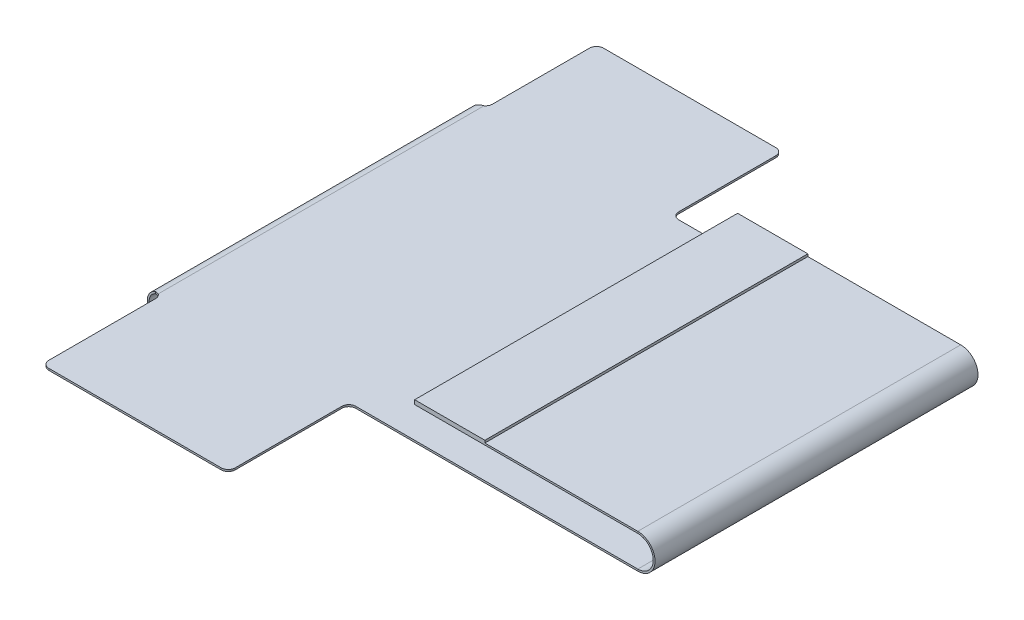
ISO-10303-21;
HEADER;
FILE_DESCRIPTION(('STEP AP214'),'2;1');
FILE_NAME('part.step','',(''),(''),'','','');
FILE_SCHEMA(('AUTOMOTIVE_DESIGN { 1 0 10303 214 1 1 1 1 }'));
ENDSEC;
DATA;
#1=APPLICATION_CONTEXT('core data for automotive mechanical design processes');
#2=APPLICATION_PROTOCOL_DEFINITION('international standard','automotive_design',2000,#1);
#3=PRODUCT_CONTEXT('',#1,'mechanical');
#4=PRODUCT('Part','Part','',(#3));
#5=PRODUCT_RELATED_PRODUCT_CATEGORY('part','',(#4));
#6=PRODUCT_DEFINITION_FORMATION('','',#4);
#7=PRODUCT_DEFINITION_CONTEXT('part definition',#1,'design');
#8=PRODUCT_DEFINITION('design','',#6,#7);
#9=PRODUCT_DEFINITION_SHAPE('','',#8);
#10=(LENGTH_UNIT() NAMED_UNIT(*) SI_UNIT(.MILLI.,.METRE.));
#11=(NAMED_UNIT(*) PLANE_ANGLE_UNIT() SI_UNIT($,.RADIAN.));
#12=(NAMED_UNIT(*) SI_UNIT($,.STERADIAN.) SOLID_ANGLE_UNIT());
#13=UNCERTAINTY_MEASURE_WITH_UNIT(LENGTH_MEASURE(1.E-05),#10,'distance_accuracy_value','');
#14=(GEOMETRIC_REPRESENTATION_CONTEXT(3) GLOBAL_UNCERTAINTY_ASSIGNED_CONTEXT((#13)) GLOBAL_UNIT_ASSIGNED_CONTEXT((#10,
#11,#12)) REPRESENTATION_CONTEXT('',''));
#15=CARTESIAN_POINT('',(0.,0.,0.));
#16=DIRECTION('',(0.,0.,1.));
#17=DIRECTION('',(1.,0.,0.));
#18=AXIS2_PLACEMENT_3D('',#15,#16,#17);
#19=CARTESIAN_POINT('',(74.6599554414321,2.33000000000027,12.));
#20=DIRECTION('',(0.,1.,0.));
#21=DIRECTION('',(0.,0.,-1.));
#22=AXIS2_PLACEMENT_3D('',#19,#20,#21);
#23=PLANE('',#22);
#24=DIRECTION('',(1.,0.,0.));
#25=VECTOR('',#24,1.);
#26=CARTESIAN_POINT('',(20.7599554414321,2.32999999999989,-11.5));
#27=LINE('',#26,#25);
#28=CARTESIAN_POINT('',(25.7599554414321,2.32999999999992,-11.5));
#29=VERTEX_POINT('',#28);
#30=CARTESIAN_POINT('',(36.65,2.33,-11.5));
#31=VERTEX_POINT('',#30);
#32=EDGE_CURVE('E426',#29,#31,#27,.T.);
#33=ORIENTED_EDGE('',*,*,#32,.F.);
#34=DIRECTION('',(0.,0.,-1.));
#35=VECTOR('',#34,1.);
#36=CARTESIAN_POINT('',(25.7599554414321,2.32999999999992,-11.5));
#37=LINE('',#36,#35);
#38=CARTESIAN_POINT('',(25.7599554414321,2.32999999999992,11.5));
#39=VERTEX_POINT('',#38);
#40=EDGE_CURVE('E406',#39,#29,#37,.T.);
#41=ORIENTED_EDGE('',*,*,#40,.F.);
#42=DIRECTION('',(-1.,0.,0.));
#43=VECTOR('',#42,1.);
#44=CARTESIAN_POINT('',(60.3899554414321,2.33000000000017,11.5));
#45=LINE('',#44,#43);
#46=CARTESIAN_POINT('',(36.65,2.33,11.5));
#47=VERTEX_POINT('',#46);
#48=EDGE_CURVE('E391',#47,#39,#45,.T.);
#49=ORIENTED_EDGE('',*,*,#48,.F.);
#50=DIRECTION('',(0.,0.,1.));
#51=VECTOR('',#50,1.);
#52=CARTESIAN_POINT('',(36.65,2.33,12.));
#53=LINE('',#52,#51);
#54=EDGE_CURVE('E415',#31,#47,#53,.T.);
#55=ORIENTED_EDGE('',*,*,#54,.F.);
#56=EDGE_LOOP('',(#33,#41,#49,#55));
#57=FACE_BOUND('',#56,.T.);
#58=ADVANCED_FACE('F180',(#57),#23,.T.);
#59=CARTESIAN_POINT('',(2.3,-0.13,12.));
#60=DIRECTION('',(0.,-1.,0.));
#61=DIRECTION('',(0.,0.,-1.));
#62=AXIS2_PLACEMENT_3D('',#59,#60,#61);
#63=PLANE('',#62);
#64=DIRECTION('',(-1.,0.,0.));
#65=VECTOR('',#64,1.);
#66=CARTESIAN_POINT('',(56.2,-0.13,-11.5));
#67=LINE('',#66,#65);
#68=CARTESIAN_POINT('',(36.65,-0.13,-11.5));
#69=VERTEX_POINT('',#68);
#70=CARTESIAN_POINT('',(16.57,-0.13,-11.5));
#71=VERTEX_POINT('',#70);
#72=EDGE_CURVE('E184',#69,#71,#67,.T.);
#73=ORIENTED_EDGE('',*,*,#72,.F.);
#74=DIRECTION('',(0.,0.,1.));
#75=VECTOR('',#74,1.);
#76=CARTESIAN_POINT('',(36.65,-0.13,12.));
#77=LINE('',#76,#75);
#78=CARTESIAN_POINT('',(36.65,-0.13,11.5));
#79=VERTEX_POINT('',#78);
#80=EDGE_CURVE('E741',#69,#79,#77,.T.);
#81=ORIENTED_EDGE('',*,*,#80,.T.);
#82=DIRECTION('',(1.,0.,0.));
#83=VECTOR('',#82,1.);
#84=CARTESIAN_POINT('',(16.57,-0.13,11.5));
#85=LINE('',#84,#83);
#86=CARTESIAN_POINT('',(16.57,-0.13,11.5));
#87=VERTEX_POINT('',#86);
#88=EDGE_CURVE('E754',#87,#79,#85,.T.);
#89=ORIENTED_EDGE('',*,*,#88,.F.);
#90=CARTESIAN_POINT('',(16.57,-0.13,12.));
#91=DIRECTION('',(0.,-1.,0.));
#92=DIRECTION('',(0.,0.,-1.));
#93=AXIS2_PLACEMENT_3D('',#90,#91,#92);
#94=CIRCLE('',#93,0.5);
#95=CARTESIAN_POINT('',(16.07,-0.13,12.));
#96=VERTEX_POINT('',#95);
#97=EDGE_CURVE('E824',#96,#87,#94,.T.);
#98=ORIENTED_EDGE('',*,*,#97,.F.);
#99=DIRECTION('',(0.,0.,-1.));
#100=VECTOR('',#99,1.);
#101=CARTESIAN_POINT('',(16.07,-0.13,19.59));
#102=LINE('',#101,#100);
#103=CARTESIAN_POINT('',(16.07,-0.13,19.59));
#104=VERTEX_POINT('',#103);
#105=EDGE_CURVE('E829',#104,#96,#102,.T.);
#106=ORIENTED_EDGE('',*,*,#105,.F.);
#107=CARTESIAN_POINT('',(15.57,-0.13,19.59));
#108=DIRECTION('',(0.,1.,0.));
#109=DIRECTION('',(0.,0.,1.));
#110=AXIS2_PLACEMENT_3D('',#107,#108,#109);
#111=CIRCLE('',#110,0.5);
#112=CARTESIAN_POINT('',(15.57,-0.13,20.09));
#113=VERTEX_POINT('',#112);
#114=EDGE_CURVE('E834',#113,#104,#111,.T.);
#115=ORIENTED_EDGE('',*,*,#114,.F.);
#116=DIRECTION('',(1.,0.,0.));
#117=VECTOR('',#116,1.);
#118=CARTESIAN_POINT('',(3.3,-0.13,20.09));
#119=LINE('',#118,#117);
#120=CARTESIAN_POINT('',(3.3,-0.13,20.09));
#121=VERTEX_POINT('',#120);
#122=EDGE_CURVE('E839',#121,#113,#119,.T.);
#123=ORIENTED_EDGE('',*,*,#122,.F.);
#124=CARTESIAN_POINT('',(3.3,-0.13,19.59));
#125=DIRECTION('',(0.,1.,0.));
#126=DIRECTION('',(0.,0.,1.));
#127=AXIS2_PLACEMENT_3D('',#124,#125,#126);
#128=CIRCLE('',#127,0.500000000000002);
#129=CARTESIAN_POINT('',(2.8,-0.13,19.59));
#130=VERTEX_POINT('',#129);
#131=EDGE_CURVE('E844',#130,#121,#128,.T.);
#132=ORIENTED_EDGE('',*,*,#131,.F.);
#133=DIRECTION('',(0.,0.,1.));
#134=VECTOR('',#133,1.);
#135=CARTESIAN_POINT('',(2.8,-0.13,12.));
#136=LINE('',#135,#134);
#137=CARTESIAN_POINT('',(2.8,-0.13,12.));
#138=VERTEX_POINT('',#137);
#139=EDGE_CURVE('E849',#138,#130,#136,.T.);
#140=ORIENTED_EDGE('',*,*,#139,.F.);
#141=CARTESIAN_POINT('',(2.3,-0.13,12.));
#142=DIRECTION('',(0.,-1.,0.));
#143=DIRECTION('',(0.,0.,-1.));
#144=AXIS2_PLACEMENT_3D('',#141,#142,#143);
#145=CIRCLE('',#144,0.5);
#146=CARTESIAN_POINT('',(2.6,-0.13,11.6));
#147=VERTEX_POINT('',#146);
#148=EDGE_CURVE('E705',#147,#138,#145,.T.);
#149=ORIENTED_EDGE('',*,*,#148,.F.);
#150=DIRECTION('',(0.,0.,1.));
#151=VECTOR('',#150,1.);
#152=CARTESIAN_POINT('',(2.6,-0.13,12.));
#153=LINE('',#152,#151);
#154=CARTESIAN_POINT('',(2.6,-0.13,-11.6));
#155=VERTEX_POINT('',#154);
#156=EDGE_CURVE('E856',#155,#147,#153,.T.);
#157=ORIENTED_EDGE('',*,*,#156,.F.);
#158=CARTESIAN_POINT('',(2.3,-0.13,-12.));
#159=DIRECTION('',(0.,-1.,0.));
#160=DIRECTION('',(0.,0.,-1.));
#161=AXIS2_PLACEMENT_3D('',#158,#159,#160);
#162=CIRCLE('',#161,0.5);
#163=CARTESIAN_POINT('',(2.8,-0.13,-12.));
#164=VERTEX_POINT('',#163);
#165=EDGE_CURVE('E690',#164,#155,#162,.T.);
#166=ORIENTED_EDGE('',*,*,#165,.F.);
#167=DIRECTION('',(0.,0.,1.));
#168=VECTOR('',#167,1.);
#169=CARTESIAN_POINT('',(2.8,-0.13,-18.91));
#170=LINE('',#169,#168);
#171=CARTESIAN_POINT('',(2.8,-0.13,-18.91));
#172=VERTEX_POINT('',#171);
#173=EDGE_CURVE('E793',#172,#164,#170,.T.);
#174=ORIENTED_EDGE('',*,*,#173,.F.);
#175=CARTESIAN_POINT('',(3.3,-0.13,-18.91));
#176=DIRECTION('',(0.,1.,0.));
#177=DIRECTION('',(0.,0.,1.));
#178=AXIS2_PLACEMENT_3D('',#175,#176,#177);
#179=CIRCLE('',#178,0.499999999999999);
#180=CARTESIAN_POINT('',(3.3,-0.13,-19.41));
#181=VERTEX_POINT('',#180);
#182=EDGE_CURVE('E798',#181,#172,#179,.T.);
#183=ORIENTED_EDGE('',*,*,#182,.F.);
#184=DIRECTION('',(-1.,0.,0.));
#185=VECTOR('',#184,1.);
#186=CARTESIAN_POINT('',(15.57,-0.13,-19.41));
#187=LINE('',#186,#185);
#188=CARTESIAN_POINT('',(15.57,-0.13,-19.41));
#189=VERTEX_POINT('',#188);
#190=EDGE_CURVE('E803',#189,#181,#187,.T.);
#191=ORIENTED_EDGE('',*,*,#190,.F.);
#192=CARTESIAN_POINT('',(15.57,-0.13,-18.91));
#193=DIRECTION('',(0.,1.,0.));
#194=DIRECTION('',(0.,0.,1.));
#195=AXIS2_PLACEMENT_3D('',#192,#193,#194);
#196=CIRCLE('',#195,0.500000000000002);
#197=CARTESIAN_POINT('',(16.07,-0.13,-18.91));
#198=VERTEX_POINT('',#197);
#199=EDGE_CURVE('E808',#198,#189,#196,.T.);
#200=ORIENTED_EDGE('',*,*,#199,.F.);
#201=DIRECTION('',(0.,0.,-1.));
#202=VECTOR('',#201,1.);
#203=CARTESIAN_POINT('',(16.07,-0.13,-12.));
#204=LINE('',#203,#202);
#205=CARTESIAN_POINT('',(16.07,-0.13,-12.));
#206=VERTEX_POINT('',#205);
#207=EDGE_CURVE('E813',#206,#198,#204,.T.);
#208=ORIENTED_EDGE('',*,*,#207,.F.);
#209=CARTESIAN_POINT('',(16.57,-0.13,-12.));
#210=DIRECTION('',(0.,-1.,0.));
#211=DIRECTION('',(0.,0.,-1.));
#212=AXIS2_PLACEMENT_3D('',#209,#210,#211);
#213=CIRCLE('',#212,0.5);
#214=EDGE_CURVE('E818',#71,#206,#213,.T.);
#215=ORIENTED_EDGE('',*,*,#214,.F.);
#216=EDGE_LOOP('',(#73,#81,#89,#98,#106,#115,#123,#132,#140,#149,#157,#166,#174,#183,#191,#200,
#208,#215));
#217=FACE_BOUND('',#216,.T.);
#218=ADVANCED_FACE('F909',(#217),#63,.T.);
#219=CARTESIAN_POINT('',(56.2,-0.13,-11.5));
#220=DIRECTION('',(0.,0.,-1.));
#221=DIRECTION('',(-1.,0.,0.));
#222=AXIS2_PLACEMENT_3D('',#219,#220,#221);
#223=PLANE('',#222);
#224=DIRECTION('',(-1.,0.,0.));
#225=VECTOR('',#224,1.);
#226=CARTESIAN_POINT('',(56.2,0.,-11.5));
#227=LINE('',#226,#225);
#228=CARTESIAN_POINT('',(36.65,0.,-11.5));
#229=VERTEX_POINT('',#228);
#230=CARTESIAN_POINT('',(16.57,0.,-11.5));
#231=VERTEX_POINT('',#230);
#232=EDGE_CURVE('E760',#229,#231,#227,.T.);
#233=ORIENTED_EDGE('',*,*,#232,.F.);
#234=DIRECTION('',(0.,-1.,0.));
#235=VECTOR('',#234,1.);
#236=CARTESIAN_POINT('',(36.65,-0.13,-11.5));
#237=LINE('',#236,#235);
#238=EDGE_CURVE('E750',#229,#69,#237,.T.);
#239=ORIENTED_EDGE('',*,*,#238,.T.);
#240=ORIENTED_EDGE('',*,*,#72,.T.);
#241=DIRECTION('',(0.,1.,0.));
#242=VECTOR('',#241,1.);
#243=CARTESIAN_POINT('',(16.57,-0.13,-11.5));
#244=LINE('',#243,#242);
#245=EDGE_CURVE('E821',#71,#231,#244,.T.);
#246=ORIENTED_EDGE('',*,*,#245,.T.);
#247=EDGE_LOOP('',(#233,#239,#240,#246));
#248=FACE_BOUND('',#247,.T.);
#249=ADVANCED_FACE('F915',(#248),#223,.T.);
#250=CARTESIAN_POINT('',(16.57,-0.13,11.5));
#251=DIRECTION('',(0.,0.,1.));
#252=DIRECTION('',(1.,0.,0.));
#253=AXIS2_PLACEMENT_3D('',#250,#251,#252);
#254=PLANE('',#253);
#255=ORIENTED_EDGE('',*,*,#88,.T.);
#256=DIRECTION('',(0.,1.,0.));
#257=VECTOR('',#256,1.);
#258=CARTESIAN_POINT('',(36.65,-0.13,11.5));
#259=LINE('',#258,#257);
#260=CARTESIAN_POINT('',(36.65,0.,11.5));
#261=VERTEX_POINT('',#260);
#262=EDGE_CURVE('E12',#79,#261,#259,.T.);
#263=ORIENTED_EDGE('',*,*,#262,.T.);
#264=DIRECTION('',(1.,0.,0.));
#265=VECTOR('',#264,1.);
#266=CARTESIAN_POINT('',(16.57,0.,11.5));
#267=LINE('',#266,#265);
#268=CARTESIAN_POINT('',(16.57,0.,11.5));
#269=VERTEX_POINT('',#268);
#270=EDGE_CURVE('E758',#269,#261,#267,.T.);
#271=ORIENTED_EDGE('',*,*,#270,.F.);
#272=DIRECTION('',(0.,1.,0.));
#273=VECTOR('',#272,1.);
#274=CARTESIAN_POINT('',(16.57,-0.13,11.5));
#275=LINE('',#274,#273);
#276=EDGE_CURVE('E757',#87,#269,#275,.T.);
#277=ORIENTED_EDGE('',*,*,#276,.F.);
#278=EDGE_LOOP('',(#255,#263,#271,#277));
#279=FACE_BOUND('',#278,.T.);
#280=ADVANCED_FACE('F182',(#279),#254,.T.);
#281=CARTESIAN_POINT('',(2.63960198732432,-1.63,11.5));
#282=DIRECTION('',(0.,0.,1.));
#283=DIRECTION('',(-1.,0.,0.));
#284=AXIS2_PLACEMENT_3D('',#281,#282,#283);
#285=PLANE('',#284);
#286=DIRECTION('',(-1.,0.,0.));
#287=VECTOR('',#286,1.);
#288=CARTESIAN_POINT('',(2.63960198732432,-1.63,11.5));
#289=LINE('',#288,#287);
#290=CARTESIAN_POINT('',(2.63960198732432,-1.63,11.5));
#291=VERTEX_POINT('',#290);
#292=CARTESIAN_POINT('',(2.60000000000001,-1.63,11.5));
#293=VERTEX_POINT('',#292);
#294=EDGE_CURVE('E718',#291,#293,#289,.T.);
#295=ORIENTED_EDGE('',*,*,#294,.T.);
#296=DIRECTION('',(0.,-1.,0.));
#297=VECTOR('',#296,1.);
#298=CARTESIAN_POINT('',(2.60000000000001,-1.63,11.5));
#299=LINE('',#298,#297);
#300=CARTESIAN_POINT('',(2.60000000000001,-1.76,11.5));
#301=VERTEX_POINT('',#300);
#302=EDGE_CURVE('E738',#293,#301,#299,.T.);
#303=ORIENTED_EDGE('',*,*,#302,.T.);
#304=DIRECTION('',(-1.,0.,0.));
#305=VECTOR('',#304,1.);
#306=CARTESIAN_POINT('',(2.63960198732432,-1.76,11.5));
#307=LINE('',#306,#305);
#308=CARTESIAN_POINT('',(2.63960198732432,-1.76,11.5));
#309=VERTEX_POINT('',#308);
#310=EDGE_CURVE('E723',#309,#301,#307,.T.);
#311=ORIENTED_EDGE('',*,*,#310,.F.);
#312=DIRECTION('',(0.,-1.,0.));
#313=VECTOR('',#312,1.);
#314=CARTESIAN_POINT('',(2.63960198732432,-1.63,11.5));
#315=LINE('',#314,#313);
#316=EDGE_CURVE('E725',#291,#309,#315,.T.);
#317=ORIENTED_EDGE('',*,*,#316,.F.);
#318=EDGE_LOOP('',(#295,#303,#311,#317));
#319=FACE_BOUND('',#318,.T.);
#320=ADVANCED_FACE('F892',(#319),#285,.T.);
#321=CARTESIAN_POINT('',(0.339601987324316,-1.63000000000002,-11.5));
#322=DIRECTION('',(0.,0.,-1.));
#323=DIRECTION('',(1.,0.,0.));
#324=AXIS2_PLACEMENT_3D('',#321,#322,#323);
#325=PLANE('',#324);
#326=DIRECTION('',(1.,0.,0.));
#327=VECTOR('',#326,1.);
#328=CARTESIAN_POINT('',(0.339601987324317,-1.76000000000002,-11.5));
#329=LINE('',#328,#327);
#330=CARTESIAN_POINT('',(2.60000000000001,-1.76,-11.5));
#331=VERTEX_POINT('',#330);
#332=CARTESIAN_POINT('',(2.63960198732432,-1.76,-11.5));
#333=VERTEX_POINT('',#332);
#334=EDGE_CURVE('E724',#331,#333,#329,.T.);
#335=ORIENTED_EDGE('',*,*,#334,.F.);
#336=DIRECTION('',(0.,1.,0.));
#337=VECTOR('',#336,1.);
#338=CARTESIAN_POINT('',(2.6,-1.63,-11.5));
#339=LINE('',#338,#337);
#340=CARTESIAN_POINT('',(2.60000000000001,-1.63,-11.5));
#341=VERTEX_POINT('',#340);
#342=EDGE_CURVE('E733',#331,#341,#339,.T.);
#343=ORIENTED_EDGE('',*,*,#342,.T.);
#344=DIRECTION('',(1.,0.,0.));
#345=VECTOR('',#344,1.);
#346=CARTESIAN_POINT('',(0.339601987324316,-1.63000000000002,-11.5));
#347=LINE('',#346,#345);
#348=CARTESIAN_POINT('',(2.63960198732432,-1.63,-11.5));
#349=VERTEX_POINT('',#348);
#350=EDGE_CURVE('E719',#341,#349,#347,.T.);
#351=ORIENTED_EDGE('',*,*,#350,.T.);
#352=DIRECTION('',(0.,-1.,0.));
#353=VECTOR('',#352,1.);
#354=CARTESIAN_POINT('',(2.63960198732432,-1.63,-11.5));
#355=LINE('',#354,#353);
#356=EDGE_CURVE('E728',#349,#333,#355,.T.);
#357=ORIENTED_EDGE('',*,*,#356,.T.);
#358=EDGE_LOOP('',(#335,#343,#351,#357));
#359=FACE_BOUND('',#358,.T.);
#360=ADVANCED_FACE('F903',(#359),#325,.T.);
#361=CARTESIAN_POINT('',(0.339601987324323,-1.63000000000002,12.));
#362=DIRECTION('',(0.,1.,0.));
#363=DIRECTION('',(0.,0.,-1.));
#364=AXIS2_PLACEMENT_3D('',#361,#362,#363);
#365=PLANE('',#364);
#366=ORIENTED_EDGE('',*,*,#350,.F.);
#367=DIRECTION('',(0.,0.,1.));
#368=VECTOR('',#367,1.);
#369=CARTESIAN_POINT('',(2.60000000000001,-1.63,12.));
#370=LINE('',#369,#368);
#371=EDGE_CURVE('E727',#341,#293,#370,.T.);
#372=ORIENTED_EDGE('',*,*,#371,.T.);
#373=ORIENTED_EDGE('',*,*,#294,.F.);
#374=DIRECTION('',(0.,0.,1.));
#375=VECTOR('',#374,1.);
#376=CARTESIAN_POINT('',(2.63960198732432,-1.63,-11.5));
#377=LINE('',#376,#375);
#378=EDGE_CURVE('E715',#349,#291,#377,.T.);
#379=ORIENTED_EDGE('',*,*,#378,.F.);
#380=EDGE_LOOP('',(#366,#372,#373,#379));
#381=FACE_BOUND('',#380,.T.);
#382=ADVANCED_FACE('F897',(#381),#365,.T.);
#383=CARTESIAN_POINT('',(2.63960198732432,-1.63,-11.5));
#384=DIRECTION('',(1.,0.,0.));
#385=DIRECTION('',(0.,0.,1.));
#386=AXIS2_PLACEMENT_3D('',#383,#384,#385);
#387=PLANE('',#386);
#388=DIRECTION('',(0.,0.,1.));
#389=VECTOR('',#388,1.);
#390=CARTESIAN_POINT('',(2.63960198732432,-1.76,-11.5));
#391=LINE('',#390,#389);
#392=EDGE_CURVE('E720',#333,#309,#391,.T.);
#393=ORIENTED_EDGE('',*,*,#392,.F.);
#394=ORIENTED_EDGE('',*,*,#356,.F.);
#395=ORIENTED_EDGE('',*,*,#378,.T.);
#396=ORIENTED_EDGE('',*,*,#316,.T.);
#397=EDGE_LOOP('',(#393,#394,#395,#396));
#398=FACE_BOUND('',#397,.T.);
#399=ADVANCED_FACE('F900',(#398),#387,.T.);
#400=CARTESIAN_POINT('',(0.339601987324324,-1.76000000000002,12.));
#401=DIRECTION('',(0.,1.,0.));
#402=DIRECTION('',(0.,0.,-1.));
#403=AXIS2_PLACEMENT_3D('',#400,#401,#402);
#404=PLANE('',#403);
#405=DIRECTION('',(0.,0.,1.));
#406=VECTOR('',#405,1.);
#407=CARTESIAN_POINT('',(2.60000000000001,-1.76,12.));
#408=LINE('',#407,#406);
#409=EDGE_CURVE('E736',#331,#301,#408,.T.);
#410=ORIENTED_EDGE('',*,*,#409,.F.);
#411=ORIENTED_EDGE('',*,*,#334,.T.);
#412=ORIENTED_EDGE('',*,*,#392,.T.);
#413=ORIENTED_EDGE('',*,*,#310,.T.);
#414=EDGE_LOOP('',(#410,#411,#412,#413));
#415=FACE_BOUND('',#414,.T.);
#416=ADVANCED_FACE('F616',(#415),#404,.F.);
#417=CARTESIAN_POINT('',(2.8,-0.13,12.));
#418=DIRECTION('',(-1.,0.,0.));
#419=DIRECTION('',(0.,0.,1.));
#420=AXIS2_PLACEMENT_3D('',#417,#418,#419);
#421=PLANE('',#420);
#422=DIRECTION('',(0.,0.,1.));
#423=VECTOR('',#422,1.);
#424=CARTESIAN_POINT('',(2.8,0.,12.));
#425=LINE('',#424,#423);
#426=CARTESIAN_POINT('',(2.8,0.,12.));
#427=VERTEX_POINT('',#426);
#428=CARTESIAN_POINT('',(2.8,0.,19.59));
#429=VERTEX_POINT('',#428);
#430=EDGE_CURVE('E694',#427,#429,#425,.T.);
#431=ORIENTED_EDGE('',*,*,#430,.F.);
#432=DIRECTION('',(0.,1.,0.));
#433=VECTOR('',#432,1.);
#434=CARTESIAN_POINT('',(2.8,-0.13,12.));
#435=LINE('',#434,#433);
#436=EDGE_CURVE('E602',#138,#427,#435,.T.);
#437=ORIENTED_EDGE('',*,*,#436,.F.);
#438=ORIENTED_EDGE('',*,*,#139,.T.);
#439=DIRECTION('',(0.,1.,0.));
#440=VECTOR('',#439,1.);
#441=CARTESIAN_POINT('',(2.8,-0.13,19.59));
#442=LINE('',#441,#440);
#443=EDGE_CURVE('E847',#130,#429,#442,.T.);
#444=ORIENTED_EDGE('',*,*,#443,.T.);
#445=EDGE_LOOP('',(#431,#437,#438,#444));
#446=FACE_BOUND('',#445,.T.);
#447=ADVANCED_FACE('F612',(#446),#421,.T.);
#448=CARTESIAN_POINT('',(3.3,-0.13,19.59));
#449=DIRECTION('',(0.,1.,0.));
#450=DIRECTION('',(0.,0.,1.));
#451=AXIS2_PLACEMENT_3D('',#448,#449,#450);
#452=CYLINDRICAL_SURFACE('',#451,0.500000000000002);
#453=CARTESIAN_POINT('',(3.3,0.,19.59));
#454=DIRECTION('',(0.,1.,0.));
#455=DIRECTION('',(0.,0.,1.));
#456=AXIS2_PLACEMENT_3D('',#453,#454,#455);
#457=CIRCLE('',#456,0.500000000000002);
#458=CARTESIAN_POINT('',(3.3,0.,20.09));
#459=VERTEX_POINT('',#458);
#460=EDGE_CURVE('E786',#429,#459,#457,.T.);
#461=ORIENTED_EDGE('',*,*,#460,.F.);
#462=ORIENTED_EDGE('',*,*,#443,.F.);
#463=ORIENTED_EDGE('',*,*,#131,.T.);
#464=DIRECTION('',(0.,1.,0.));
#465=VECTOR('',#464,1.);
#466=CARTESIAN_POINT('',(3.3,-0.13,20.09));
#467=LINE('',#466,#465);
#468=EDGE_CURVE('E842',#121,#459,#467,.T.);
#469=ORIENTED_EDGE('',*,*,#468,.T.);
#470=EDGE_LOOP('',(#461,#462,#463,#469));
#471=FACE_BOUND('',#470,.T.);
#472=ADVANCED_FACE('F615',(#471),#452,.T.);
#473=CARTESIAN_POINT('',(3.3,-0.13,20.09));
#474=DIRECTION('',(0.,0.,1.));
#475=DIRECTION('',(1.,0.,0.));
#476=AXIS2_PLACEMENT_3D('',#473,#474,#475);
#477=PLANE('',#476);
#478=DIRECTION('',(1.,0.,0.));
#479=VECTOR('',#478,1.);
#480=CARTESIAN_POINT('',(3.3,0.,20.09));
#481=LINE('',#480,#479);
#482=CARTESIAN_POINT('',(15.57,0.,20.09));
#483=VERTEX_POINT('',#482);
#484=EDGE_CURVE('E783',#459,#483,#481,.T.);
#485=ORIENTED_EDGE('',*,*,#484,.F.);
#486=ORIENTED_EDGE('',*,*,#468,.F.);
#487=ORIENTED_EDGE('',*,*,#122,.T.);
#488=DIRECTION('',(0.,1.,0.));
#489=VECTOR('',#488,1.);
#490=CARTESIAN_POINT('',(15.57,-0.13,20.09));
#491=LINE('',#490,#489);
#492=EDGE_CURVE('E837',#113,#483,#491,.T.);
#493=ORIENTED_EDGE('',*,*,#492,.T.);
#494=EDGE_LOOP('',(#485,#486,#487,#493));
#495=FACE_BOUND('',#494,.T.);
#496=ADVANCED_FACE('F620',(#495),#477,.T.);
#497=CARTESIAN_POINT('',(15.57,-0.13,19.59));
#498=DIRECTION('',(0.,1.,0.));
#499=DIRECTION('',(0.,0.,1.));
#500=AXIS2_PLACEMENT_3D('',#497,#498,#499);
#501=CYLINDRICAL_SURFACE('',#500,0.5);
#502=CARTESIAN_POINT('',(15.57,0.,19.59));
#503=DIRECTION('',(0.,1.,0.));
#504=DIRECTION('',(0.,0.,1.));
#505=AXIS2_PLACEMENT_3D('',#502,#503,#504);
#506=CIRCLE('',#505,0.5);
#507=CARTESIAN_POINT('',(16.07,0.,19.59));
#508=VERTEX_POINT('',#507);
#509=EDGE_CURVE('E780',#483,#508,#506,.T.);
#510=ORIENTED_EDGE('',*,*,#509,.F.);
#511=ORIENTED_EDGE('',*,*,#492,.F.);
#512=ORIENTED_EDGE('',*,*,#114,.T.);
#513=DIRECTION('',(0.,1.,0.));
#514=VECTOR('',#513,1.);
#515=CARTESIAN_POINT('',(16.07,-0.13,19.59));
#516=LINE('',#515,#514);
#517=EDGE_CURVE('E832',#104,#508,#516,.T.);
#518=ORIENTED_EDGE('',*,*,#517,.T.);
#519=EDGE_LOOP('',(#510,#511,#512,#518));
#520=FACE_BOUND('',#519,.T.);
#521=ADVANCED_FACE('F624',(#520),#501,.T.);
#522=CARTESIAN_POINT('',(16.07,-0.13,19.59));
#523=DIRECTION('',(1.,0.,0.));
#524=DIRECTION('',(0.,0.,-1.));
#525=AXIS2_PLACEMENT_3D('',#522,#523,#524);
#526=PLANE('',#525);
#527=DIRECTION('',(0.,0.,-1.));
#528=VECTOR('',#527,1.);
#529=CARTESIAN_POINT('',(16.07,0.,19.59));
#530=LINE('',#529,#528);
#531=CARTESIAN_POINT('',(16.07,0.,12.));
#532=VERTEX_POINT('',#531);
#533=EDGE_CURVE('E777',#508,#532,#530,.T.);
#534=ORIENTED_EDGE('',*,*,#533,.F.);
#535=ORIENTED_EDGE('',*,*,#517,.F.);
#536=ORIENTED_EDGE('',*,*,#105,.T.);
#537=DIRECTION('',(0.,1.,0.));
#538=VECTOR('',#537,1.);
#539=CARTESIAN_POINT('',(16.07,-0.13,12.));
#540=LINE('',#539,#538);
#541=EDGE_CURVE('E827',#96,#532,#540,.T.);
#542=ORIENTED_EDGE('',*,*,#541,.T.);
#543=EDGE_LOOP('',(#534,#535,#536,#542));
#544=FACE_BOUND('',#543,.T.);
#545=ADVANCED_FACE('F628',(#544),#526,.T.);
#546=CARTESIAN_POINT('',(16.57,-0.13,12.));
#547=DIRECTION('',(0.,1.,0.));
#548=DIRECTION('',(0.,0.,1.));
#549=AXIS2_PLACEMENT_3D('',#546,#547,#548);
#550=CYLINDRICAL_SURFACE('',#549,0.5);
#551=CARTESIAN_POINT('',(16.57,0.,12.));
#552=DIRECTION('',(0.,-1.,0.));
#553=DIRECTION('',(0.,0.,-1.));
#554=AXIS2_PLACEMENT_3D('',#551,#552,#553);
#555=CIRCLE('',#554,0.5);
#556=EDGE_CURVE('E761',#532,#269,#555,.T.);
#557=ORIENTED_EDGE('',*,*,#556,.F.);
#558=ORIENTED_EDGE('',*,*,#541,.F.);
#559=ORIENTED_EDGE('',*,*,#97,.T.);
#560=ORIENTED_EDGE('',*,*,#276,.T.);
#561=EDGE_LOOP('',(#557,#558,#559,#560));
#562=FACE_BOUND('',#561,.T.);
#563=ADVANCED_FACE('F632',(#562),#550,.F.);
#564=CARTESIAN_POINT('',(16.57,-0.13,-12.));
#565=DIRECTION('',(0.,1.,0.));
#566=DIRECTION('',(0.,0.,1.));
#567=AXIS2_PLACEMENT_3D('',#564,#565,#566);
#568=CYLINDRICAL_SURFACE('',#567,0.5);
#569=CARTESIAN_POINT('',(16.57,0.,-12.));
#570=DIRECTION('',(0.,-1.,0.));
#571=DIRECTION('',(0.,0.,-1.));
#572=AXIS2_PLACEMENT_3D('',#569,#570,#571);
#573=CIRCLE('',#572,0.5);
#574=CARTESIAN_POINT('',(16.07,0.,-12.));
#575=VERTEX_POINT('',#574);
#576=EDGE_CURVE('E762',#231,#575,#573,.T.);
#577=ORIENTED_EDGE('',*,*,#576,.F.);
#578=ORIENTED_EDGE('',*,*,#245,.F.);
#579=ORIENTED_EDGE('',*,*,#214,.T.);
#580=DIRECTION('',(0.,1.,0.));
#581=VECTOR('',#580,1.);
#582=CARTESIAN_POINT('',(16.07,-0.13,-12.));
#583=LINE('',#582,#581);
#584=EDGE_CURVE('E816',#206,#575,#583,.T.);
#585=ORIENTED_EDGE('',*,*,#584,.T.);
#586=EDGE_LOOP('',(#577,#578,#579,#585));
#587=FACE_BOUND('',#586,.T.);
#588=ADVANCED_FACE('F636',(#587),#568,.F.);
#589=CARTESIAN_POINT('',(16.07,-0.13,-12.));
#590=DIRECTION('',(1.,0.,0.));
#591=DIRECTION('',(0.,0.,-1.));
#592=AXIS2_PLACEMENT_3D('',#589,#590,#591);
#593=PLANE('',#592);
#594=DIRECTION('',(0.,0.,-1.));
#595=VECTOR('',#594,1.);
#596=CARTESIAN_POINT('',(16.07,0.,-12.));
#597=LINE('',#596,#595);
#598=CARTESIAN_POINT('',(16.07,0.,-18.91));
#599=VERTEX_POINT('',#598);
#600=EDGE_CURVE('E767',#575,#599,#597,.T.);
#601=ORIENTED_EDGE('',*,*,#600,.F.);
#602=ORIENTED_EDGE('',*,*,#584,.F.);
#603=ORIENTED_EDGE('',*,*,#207,.T.);
#604=DIRECTION('',(0.,1.,0.));
#605=VECTOR('',#604,1.);
#606=CARTESIAN_POINT('',(16.07,-0.13,-18.91));
#607=LINE('',#606,#605);
#608=EDGE_CURVE('E811',#198,#599,#607,.T.);
#609=ORIENTED_EDGE('',*,*,#608,.T.);
#610=EDGE_LOOP('',(#601,#602,#603,#609));
#611=FACE_BOUND('',#610,.T.);
#612=ADVANCED_FACE('F640',(#611),#593,.T.);
#613=CARTESIAN_POINT('',(15.57,-0.13,-18.91));
#614=DIRECTION('',(0.,1.,0.));
#615=DIRECTION('',(0.,0.,1.));
#616=AXIS2_PLACEMENT_3D('',#613,#614,#615);
#617=CYLINDRICAL_SURFACE('',#616,0.500000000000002);
#618=CARTESIAN_POINT('',(15.57,0.,-18.91));
#619=DIRECTION('',(0.,1.,0.));
#620=DIRECTION('',(0.,0.,1.));
#621=AXIS2_PLACEMENT_3D('',#618,#619,#620);
#622=CIRCLE('',#621,0.500000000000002);
#623=CARTESIAN_POINT('',(15.57,0.,-19.41));
#624=VERTEX_POINT('',#623);
#625=EDGE_CURVE('E771',#599,#624,#622,.T.);
#626=ORIENTED_EDGE('',*,*,#625,.F.);
#627=ORIENTED_EDGE('',*,*,#608,.F.);
#628=ORIENTED_EDGE('',*,*,#199,.T.);
#629=DIRECTION('',(0.,1.,0.));
#630=VECTOR('',#629,1.);
#631=CARTESIAN_POINT('',(15.57,-0.13,-19.41));
#632=LINE('',#631,#630);
#633=EDGE_CURVE('E806',#189,#624,#632,.T.);
#634=ORIENTED_EDGE('',*,*,#633,.T.);
#635=EDGE_LOOP('',(#626,#627,#628,#634));
#636=FACE_BOUND('',#635,.T.);
#637=ADVANCED_FACE('F644',(#636),#617,.T.);
#638=CARTESIAN_POINT('',(15.57,-0.13,-19.41));
#639=DIRECTION('',(0.,0.,-1.));
#640=DIRECTION('',(-1.,0.,0.));
#641=AXIS2_PLACEMENT_3D('',#638,#639,#640);
#642=PLANE('',#641);
#643=DIRECTION('',(-1.,0.,0.));
#644=VECTOR('',#643,1.);
#645=CARTESIAN_POINT('',(15.57,0.,-19.41));
#646=LINE('',#645,#644);
#647=CARTESIAN_POINT('',(3.3,0.,-19.41));
#648=VERTEX_POINT('',#647);
#649=EDGE_CURVE('E969',#624,#648,#646,.T.);
#650=ORIENTED_EDGE('',*,*,#649,.F.);
#651=ORIENTED_EDGE('',*,*,#633,.F.);
#652=ORIENTED_EDGE('',*,*,#190,.T.);
#653=DIRECTION('',(0.,1.,0.));
#654=VECTOR('',#653,1.);
#655=CARTESIAN_POINT('',(3.3,-0.13,-19.41));
#656=LINE('',#655,#654);
#657=EDGE_CURVE('E801',#181,#648,#656,.T.);
#658=ORIENTED_EDGE('',*,*,#657,.T.);
#659=EDGE_LOOP('',(#650,#651,#652,#658));
#660=FACE_BOUND('',#659,.T.);
#661=ADVANCED_FACE('F648',(#660),#642,.T.);
#662=CARTESIAN_POINT('',(3.3,-0.13,-18.91));
#663=DIRECTION('',(0.,1.,0.));
#664=DIRECTION('',(0.,0.,1.));
#665=AXIS2_PLACEMENT_3D('',#662,#663,#664);
#666=CYLINDRICAL_SURFACE('',#665,0.499999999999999);
#667=CARTESIAN_POINT('',(3.3,0.,-18.91));
#668=DIRECTION('',(0.,1.,0.));
#669=DIRECTION('',(0.,0.,1.));
#670=AXIS2_PLACEMENT_3D('',#667,#668,#669);
#671=CIRCLE('',#670,0.499999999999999);
#672=CARTESIAN_POINT('',(2.8,0.,-18.91));
#673=VERTEX_POINT('',#672);
#674=EDGE_CURVE('E970',#648,#673,#671,.T.);
#675=ORIENTED_EDGE('',*,*,#674,.F.);
#676=ORIENTED_EDGE('',*,*,#657,.F.);
#677=ORIENTED_EDGE('',*,*,#182,.T.);
#678=DIRECTION('',(0.,1.,0.));
#679=VECTOR('',#678,1.);
#680=CARTESIAN_POINT('',(2.8,-0.13,-18.91));
#681=LINE('',#680,#679);
#682=EDGE_CURVE('E796',#172,#673,#681,.T.);
#683=ORIENTED_EDGE('',*,*,#682,.T.);
#684=EDGE_LOOP('',(#675,#676,#677,#683));
#685=FACE_BOUND('',#684,.T.);
#686=ADVANCED_FACE('F652',(#685),#666,.T.);
#687=CARTESIAN_POINT('',(2.8,-0.13,-18.91));
#688=DIRECTION('',(-1.,0.,0.));
#689=DIRECTION('',(0.,0.,1.));
#690=AXIS2_PLACEMENT_3D('',#687,#688,#689);
#691=PLANE('',#690);
#692=DIRECTION('',(0.,0.,1.));
#693=VECTOR('',#692,1.);
#694=CARTESIAN_POINT('',(2.8,0.,-18.91));
#695=LINE('',#694,#693);
#696=CARTESIAN_POINT('',(2.8,0.,-12.));
#697=VERTEX_POINT('',#696);
#698=EDGE_CURVE('E712',#673,#697,#695,.T.);
#699=ORIENTED_EDGE('',*,*,#698,.F.);
#700=ORIENTED_EDGE('',*,*,#682,.F.);
#701=ORIENTED_EDGE('',*,*,#173,.T.);
#702=DIRECTION('',(0.,1.,0.));
#703=VECTOR('',#702,1.);
#704=CARTESIAN_POINT('',(2.8,-0.13,-12.));
#705=LINE('',#704,#703);
#706=EDGE_CURVE('E791',#164,#697,#705,.T.);
#707=ORIENTED_EDGE('',*,*,#706,.T.);
#708=EDGE_LOOP('',(#699,#700,#701,#707));
#709=FACE_BOUND('',#708,.T.);
#710=ADVANCED_FACE('F656',(#709),#691,.T.);
#711=CARTESIAN_POINT('',(2.3,-0.13,-12.));
#712=DIRECTION('',(0.,1.,0.));
#713=DIRECTION('',(0.,0.,1.));
#714=AXIS2_PLACEMENT_3D('',#711,#712,#713);
#715=CYLINDRICAL_SURFACE('',#714,0.5);
#716=CARTESIAN_POINT('',(2.6,0.,-11.6));
#717=CARTESIAN_POINT('',(2.6,-0.13,-11.6));
#718=B_SPLINE_CURVE_WITH_KNOTS('',1,(#716,#717),.UNSPECIFIED.,.F.,.F.,(2,2),(0.,1.),.UNSPECIFIED.);
#719=CARTESIAN_POINT('',(2.6,0.,-11.6));
#720=VERTEX_POINT('',#719);
#721=EDGE_CURVE('E852',#720,#155,#718,.T.);
#722=ORIENTED_EDGE('',*,*,#721,.F.);
#723=CARTESIAN_POINT('',(2.3,0.,-12.));
#724=DIRECTION('',(0.,-1.,0.));
#725=DIRECTION('',(0.,0.,-1.));
#726=AXIS2_PLACEMENT_3D('',#723,#724,#725);
#727=CIRCLE('',#726,0.5);
#728=EDGE_CURVE('E686',#697,#720,#727,.T.);
#729=ORIENTED_EDGE('',*,*,#728,.F.);
#730=ORIENTED_EDGE('',*,*,#706,.F.);
#731=ORIENTED_EDGE('',*,*,#165,.T.);
#732=EDGE_LOOP('',(#722,#729,#730,#731));
#733=FACE_BOUND('',#732,.T.);
#734=ADVANCED_FACE('F660',(#733),#715,.F.);
#735=CARTESIAN_POINT('',(2.3,0.,12.));
#736=DIRECTION('',(0.,-1.,0.));
#737=DIRECTION('',(0.,0.,-1.));
#738=AXIS2_PLACEMENT_3D('',#735,#736,#737);
#739=PLANE('',#738);
#740=DIRECTION('',(0.,0.,1.));
#741=VECTOR('',#740,1.);
#742=CARTESIAN_POINT('',(36.65,0.,12.));
#743=LINE('',#742,#741);
#744=EDGE_CURVE('E189',#229,#261,#743,.T.);
#745=ORIENTED_EDGE('',*,*,#744,.F.);
#746=ORIENTED_EDGE('',*,*,#232,.T.);
#747=ORIENTED_EDGE('',*,*,#576,.T.);
#748=ORIENTED_EDGE('',*,*,#600,.T.);
#749=ORIENTED_EDGE('',*,*,#625,.T.);
#750=ORIENTED_EDGE('',*,*,#649,.T.);
#751=ORIENTED_EDGE('',*,*,#674,.T.);
#752=ORIENTED_EDGE('',*,*,#698,.T.);
#753=ORIENTED_EDGE('',*,*,#728,.T.);
#754=DIRECTION('',(0.,0.,1.));
#755=VECTOR('',#754,1.);
#756=CARTESIAN_POINT('',(2.6,0.,12.));
#757=LINE('',#756,#755);
#758=CARTESIAN_POINT('',(2.6,0.,11.6));
#759=VERTEX_POINT('',#758);
#760=EDGE_CURVE('E677',#720,#759,#757,.T.);
#761=ORIENTED_EDGE('',*,*,#760,.T.);
#762=CARTESIAN_POINT('',(2.3,0.,12.));
#763=DIRECTION('',(0.,-1.,0.));
#764=DIRECTION('',(0.,0.,-1.));
#765=AXIS2_PLACEMENT_3D('',#762,#763,#764);
#766=CIRCLE('',#765,0.5);
#767=EDGE_CURVE('E685',#759,#427,#766,.T.);
#768=ORIENTED_EDGE('',*,*,#767,.T.);
#769=ORIENTED_EDGE('',*,*,#430,.T.);
#770=ORIENTED_EDGE('',*,*,#460,.T.);
#771=ORIENTED_EDGE('',*,*,#484,.T.);
#772=ORIENTED_EDGE('',*,*,#509,.T.);
#773=ORIENTED_EDGE('',*,*,#533,.T.);
#774=ORIENTED_EDGE('',*,*,#556,.T.);
#775=ORIENTED_EDGE('',*,*,#270,.T.);
#776=EDGE_LOOP('',(#745,#746,#747,#748,#749,#750,#751,#752,#753,#761,#768,#769,#770,#771,#772,
#773,#774,#775));
#777=FACE_BOUND('',#776,.T.);
#778=ADVANCED_FACE('F665',(#777),#739,.F.);
#779=CARTESIAN_POINT('',(2.3,-0.13,12.));
#780=DIRECTION('',(0.,1.,0.));
#781=DIRECTION('',(0.,0.,1.));
#782=AXIS2_PLACEMENT_3D('',#779,#780,#781);
#783=CYLINDRICAL_SURFACE('',#782,0.5);
#784=CARTESIAN_POINT('',(2.6,-0.13,11.6));
#785=CARTESIAN_POINT('',(2.6,0.,11.6));
#786=B_SPLINE_CURVE_WITH_KNOTS('',1,(#784,#785),.UNSPECIFIED.,.F.,.F.,(2,2),(0.,1.),.UNSPECIFIED.);
#787=EDGE_CURVE('E701',#147,#759,#786,.T.);
#788=ORIENTED_EDGE('',*,*,#787,.F.);
#789=ORIENTED_EDGE('',*,*,#148,.T.);
#790=ORIENTED_EDGE('',*,*,#436,.T.);
#791=ORIENTED_EDGE('',*,*,#767,.F.);
#792=EDGE_LOOP('',(#788,#789,#790,#791));
#793=FACE_BOUND('',#792,.T.);
#794=ADVANCED_FACE('F667',(#793),#783,.F.);
#795=CARTESIAN_POINT('',(2.6,-0.88,-11.5));
#796=DIRECTION('',(0.,0.,1.));
#797=DIRECTION('',(1.,0.,0.));
#798=AXIS2_PLACEMENT_3D('',#795,#796,#797);
#799=PLANE('',#798);
#800=ORIENTED_EDGE('',*,*,#342,.F.);
#801=CARTESIAN_POINT('',(2.6,-0.88,-11.5));
#802=DIRECTION('',(0.,0.,-1.));
#803=DIRECTION('',(-1.,0.,0.));
#804=AXIS2_PLACEMENT_3D('',#801,#802,#803);
#805=CIRCLE('',#804,0.88);
#806=CARTESIAN_POINT('',(2.28333935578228,-0.0589482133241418,-11.5));
#807=VERTEX_POINT('',#806);
#808=EDGE_CURVE('E445',#331,#807,#805,.T.);
#809=ORIENTED_EDGE('',*,*,#808,.T.);
#810=CARTESIAN_POINT('',(2.33011876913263,-0.180239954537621,-11.5));
#811=CARTESIAN_POINT('',(2.28333935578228,-0.0589482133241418,-11.5));
#812=B_SPLINE_CURVE_WITH_KNOTS('',1,(#810,#811),.UNSPECIFIED.,.F.,.F.,(2,2),(0.,1.),.UNSPECIFIED.);
#813=CARTESIAN_POINT('',(2.33011876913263,-0.180239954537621,-11.5));
#814=VERTEX_POINT('',#813);
#815=EDGE_CURVE('E566',#807,#814,#812,.F.);
#816=ORIENTED_EDGE('',*,*,#815,.T.);
#817=CARTESIAN_POINT('',(2.6,-0.88,-11.5));
#818=DIRECTION('',(0.,0.,-1.));
#819=DIRECTION('',(1.,0.,0.));
#820=AXIS2_PLACEMENT_3D('',#817,#818,#819);
#821=CIRCLE('',#820,0.75);
#822=EDGE_CURVE('E490',#341,#814,#821,.T.);
#823=ORIENTED_EDGE('',*,*,#822,.F.);
#824=EDGE_LOOP('',(#800,#809,#816,#823));
#825=FACE_BOUND('',#824,.T.);
#826=ADVANCED_FACE('F534',(#825),#799,.F.);
#827=CARTESIAN_POINT('',(2.28333935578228,-0.0589482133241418,-11.5));
#828=CARTESIAN_POINT('',(2.38412536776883,-0.0200773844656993,-11.5333477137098));
#829=CARTESIAN_POINT('',(2.49197795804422,0.,-11.5666522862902));
#830=CARTESIAN_POINT('',(2.6,0.,-11.6));
#831=CARTESIAN_POINT('',(2.33011876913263,-0.180239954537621,-11.5));
#832=CARTESIAN_POINT('',(2.41601494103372,-0.147111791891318,-11.5333473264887));
#833=CARTESIAN_POINT('',(2.50793682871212,-0.13,-11.5666526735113));
#834=CARTESIAN_POINT('',(2.6,-0.13,-11.6));
#835=B_SPLINE_SURFACE_WITH_KNOTS('',1,3,((#827,#828,#829,#830),(#831,#832,#833,#834)),
.UNSPECIFIED.,.F.,.F.,.F.,(2,2),(4,4),(0.,1.),(0.,1.),.UNSPECIFIED.);
#836=CARTESIAN_POINT('',(2.28333935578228,-0.0589482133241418,-11.5));
#837=CARTESIAN_POINT('',(2.38412536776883,-0.0200773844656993,-11.5333477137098));
#838=CARTESIAN_POINT('',(2.49197795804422,0.,-11.5666522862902));
#839=CARTESIAN_POINT('',(2.6,0.,-11.6));
#840=B_SPLINE_CURVE_WITH_KNOTS('',3,(#836,#837,#838,#839),.UNSPECIFIED.,.F.,.F.,(4,4),(0.,1.),.UNSPECIFIED.);
#841=EDGE_CURVE('E501',#807,#720,#840,.T.);
#842=CARTESIAN_POINT('',(2.6,-0.13,-11.6));
#843=CARTESIAN_POINT('',(2.50793682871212,-0.13,-11.5666526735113));
#844=CARTESIAN_POINT('',(2.41601494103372,-0.147111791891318,-11.5333473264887));
#845=CARTESIAN_POINT('',(2.33011876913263,-0.180239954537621,-11.5));
#846=B_SPLINE_CURVE_WITH_KNOTS('',3,(#842,#843,#844,#845),.UNSPECIFIED.,.F.,.F.,(4,4),(0.,1.),.UNSPECIFIED.);
#847=EDGE_CURVE('E489',#814,#155,#846,.F.);
#848=ORIENTED_EDGE('',*,*,#815,.F.);
#849=ORIENTED_EDGE('',*,*,#841,.T.);
#850=ORIENTED_EDGE('',*,*,#721,.T.);
#851=ORIENTED_EDGE('',*,*,#847,.F.);
#852=EDGE_LOOP('',(#848,#849,#850,#851));
#853=FACE_BOUND('',#852,.T.);
#854=ADVANCED_FACE('F522',(#853),#835,.F.);
#855=CARTESIAN_POINT('',(2.6,0.,11.6));
#856=CARTESIAN_POINT('',(2.49197795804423,0.,11.5666522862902));
#857=CARTESIAN_POINT('',(2.38412536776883,-0.0200773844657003,11.5333477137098));
#858=CARTESIAN_POINT('',(2.28333935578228,-0.0589482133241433,11.5));
#859=CARTESIAN_POINT('',(2.6,-0.13,11.6));
#860=CARTESIAN_POINT('',(2.50793682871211,-0.13,11.5666526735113));
#861=CARTESIAN_POINT('',(2.41601494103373,-0.147111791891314,11.5333473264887));
#862=CARTESIAN_POINT('',(2.33011876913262,-0.180239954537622,11.5));
#863=B_SPLINE_SURFACE_WITH_KNOTS('',1,3,((#855,#856,#857,#858),(#859,#860,#861,#862)),
.UNSPECIFIED.,.F.,.F.,.F.,(2,2),(4,4),(0.,1.),(0.,1.),.UNSPECIFIED.);
#864=CARTESIAN_POINT('',(2.6,0.,11.6));
#865=CARTESIAN_POINT('',(2.49197795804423,0.,11.5666522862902));
#866=CARTESIAN_POINT('',(2.38412536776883,-0.0200773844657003,11.5333477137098));
#867=CARTESIAN_POINT('',(2.28333935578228,-0.0589482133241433,11.5));
#868=B_SPLINE_CURVE_WITH_KNOTS('',3,(#864,#865,#866,#867),.UNSPECIFIED.,.F.,.F.,(4,4),(0.,1.),.UNSPECIFIED.);
#869=CARTESIAN_POINT('',(2.28333935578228,-0.0589482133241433,11.5));
#870=VERTEX_POINT('',#869);
#871=EDGE_CURVE('E867',#759,#870,#868,.T.);
#872=CARTESIAN_POINT('',(2.28333935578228,-0.0589482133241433,11.5));
#873=CARTESIAN_POINT('',(2.33011876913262,-0.180239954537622,11.5));
#874=B_SPLINE_CURVE_WITH_KNOTS('',1,(#872,#873),.UNSPECIFIED.,.F.,.F.,(2,2),(0.,1.),.UNSPECIFIED.);
#875=CARTESIAN_POINT('',(2.33011876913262,-0.180239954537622,11.5));
#876=VERTEX_POINT('',#875);
#877=EDGE_CURVE('E587',#870,#876,#874,.T.);
#878=CARTESIAN_POINT('',(2.33011876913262,-0.180239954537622,11.5));
#879=CARTESIAN_POINT('',(2.41601494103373,-0.147111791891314,11.5333473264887));
#880=CARTESIAN_POINT('',(2.50793682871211,-0.13,11.5666526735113));
#881=CARTESIAN_POINT('',(2.6,-0.13,11.6));
#882=B_SPLINE_CURVE_WITH_KNOTS('',3,(#878,#879,#880,#881),.UNSPECIFIED.,.F.,.F.,(4,4),(0.,1.),.UNSPECIFIED.);
#883=EDGE_CURVE('E859',#147,#876,#882,.F.);
#884=ORIENTED_EDGE('',*,*,#787,.T.);
#885=ORIENTED_EDGE('',*,*,#871,.T.);
#886=ORIENTED_EDGE('',*,*,#877,.T.);
#887=ORIENTED_EDGE('',*,*,#883,.F.);
#888=EDGE_LOOP('',(#884,#885,#886,#887));
#889=FACE_BOUND('',#888,.T.);
#890=ADVANCED_FACE('F533',(#889),#863,.F.);
#891=CARTESIAN_POINT('',(2.6,-0.88,11.5));
#892=DIRECTION('',(0.,0.,-1.));
#893=DIRECTION('',(-1.,0.,0.));
#894=AXIS2_PLACEMENT_3D('',#891,#892,#893);
#895=PLANE('',#894);
#896=CARTESIAN_POINT('',(2.6,-0.88,11.5));
#897=DIRECTION('',(0.,0.,-1.));
#898=DIRECTION('',(-1.,0.,0.));
#899=AXIS2_PLACEMENT_3D('',#896,#897,#898);
#900=CIRCLE('',#899,0.88);
#901=EDGE_CURVE('E492',#870,#301,#900,.F.);
#902=ORIENTED_EDGE('',*,*,#901,.T.);
#903=ORIENTED_EDGE('',*,*,#302,.F.);
#904=CARTESIAN_POINT('',(2.6,-0.88,11.5));
#905=DIRECTION('',(0.,0.,1.));
#906=DIRECTION('',(-1.,0.,0.));
#907=AXIS2_PLACEMENT_3D('',#904,#905,#906);
#908=CIRCLE('',#907,0.75);
#909=EDGE_CURVE('E204',#876,#293,#908,.T.);
#910=ORIENTED_EDGE('',*,*,#909,.F.);
#911=ORIENTED_EDGE('',*,*,#877,.F.);
#912=EDGE_LOOP('',(#902,#903,#910,#911));
#913=FACE_BOUND('',#912,.T.);
#914=ADVANCED_FACE('F465',(#913),#895,.F.);
#915=CARTESIAN_POINT('',(2.6,-0.88,23.3412197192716));
#916=DIRECTION('',(0.,0.,-1.));
#917=DIRECTION('',(-1.,0.,0.));
#918=AXIS2_PLACEMENT_3D('',#915,#916,#917);
#919=CYLINDRICAL_SURFACE('',#918,0.75);
#920=ORIENTED_EDGE('',*,*,#883,.T.);
#921=ORIENTED_EDGE('',*,*,#909,.T.);
#922=ORIENTED_EDGE('',*,*,#371,.F.);
#923=ORIENTED_EDGE('',*,*,#822,.T.);
#924=ORIENTED_EDGE('',*,*,#847,.T.);
#925=ORIENTED_EDGE('',*,*,#156,.T.);
#926=EDGE_LOOP('',(#920,#921,#922,#923,#924,#925));
#927=FACE_BOUND('',#926,.T.);
#928=ADVANCED_FACE('F454',(#927),#919,.F.);
#929=CARTESIAN_POINT('',(2.6,-0.88,23.3412197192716));
#930=DIRECTION('',(0.,0.,-1.));
#931=DIRECTION('',(-1.,0.,0.));
#932=AXIS2_PLACEMENT_3D('',#929,#930,#931);
#933=CYLINDRICAL_SURFACE('',#932,0.88);
#934=ORIENTED_EDGE('',*,*,#871,.F.);
#935=ORIENTED_EDGE('',*,*,#760,.F.);
#936=ORIENTED_EDGE('',*,*,#841,.F.);
#937=ORIENTED_EDGE('',*,*,#808,.F.);
#938=ORIENTED_EDGE('',*,*,#409,.T.);
#939=ORIENTED_EDGE('',*,*,#901,.F.);
#940=EDGE_LOOP('',(#934,#935,#936,#937,#938,#939));
#941=FACE_BOUND('',#940,.T.);
#942=ADVANCED_FACE('F464',(#941),#933,.T.);
#943=CARTESIAN_POINT('',(36.65,1.1,-11.5));
#944=DIRECTION('',(0.,0.,-1.));
#945=DIRECTION('',(-1.,0.,0.));
#946=AXIS2_PLACEMENT_3D('',#943,#944,#945);
#947=PLANE('',#946);
#948=ORIENTED_EDGE('',*,*,#238,.F.);
#949=CARTESIAN_POINT('',(36.65,1.1,-11.5));
#950=DIRECTION('',(0.,0.,1.));
#951=DIRECTION('',(1.,0.,0.));
#952=AXIS2_PLACEMENT_3D('',#949,#950,#951);
#953=CIRCLE('',#952,1.1);
#954=CARTESIAN_POINT('',(36.65,2.2,-11.5));
#955=VERTEX_POINT('',#954);
#956=EDGE_CURVE('E390',#229,#955,#953,.T.);
#957=ORIENTED_EDGE('',*,*,#956,.T.);
#958=DIRECTION('',(0.,1.,0.));
#959=VECTOR('',#958,1.);
#960=CARTESIAN_POINT('',(36.65,2.33,-11.5));
#961=LINE('',#960,#959);
#962=EDGE_CURVE('E430',#955,#31,#961,.T.);
#963=ORIENTED_EDGE('',*,*,#962,.T.);
#964=CARTESIAN_POINT('',(36.65,1.1,-11.5));
#965=DIRECTION('',(0.,0.,1.));
#966=DIRECTION('',(-1.,0.,0.));
#967=AXIS2_PLACEMENT_3D('',#964,#965,#966);
#968=CIRCLE('',#967,1.23);
#969=EDGE_CURVE('E438',#69,#31,#968,.T.);
#970=ORIENTED_EDGE('',*,*,#969,.F.);
#971=EDGE_LOOP('',(#948,#957,#963,#970));
#972=FACE_BOUND('',#971,.T.);
#973=ADVANCED_FACE('F466',(#972),#947,.T.);
#974=CARTESIAN_POINT('',(36.65,1.1,11.5));
#975=DIRECTION('',(0.,0.,1.));
#976=DIRECTION('',(1.,0.,0.));
#977=AXIS2_PLACEMENT_3D('',#974,#975,#976);
#978=PLANE('',#977);
#979=DIRECTION('',(0.,-1.,0.));
#980=VECTOR('',#979,1.);
#981=CARTESIAN_POINT('',(36.65,2.33,11.5));
#982=LINE('',#981,#980);
#983=CARTESIAN_POINT('',(36.65,2.2,11.5));
#984=VERTEX_POINT('',#983);
#985=EDGE_CURVE('E433',#47,#984,#982,.T.);
#986=ORIENTED_EDGE('',*,*,#985,.T.);
#987=CARTESIAN_POINT('',(36.65,1.1,11.5));
#988=DIRECTION('',(0.,0.,1.));
#989=DIRECTION('',(1.,0.,0.));
#990=AXIS2_PLACEMENT_3D('',#987,#988,#989);
#991=CIRCLE('',#990,1.1);
#992=EDGE_CURVE('E442',#984,#261,#991,.F.);
#993=ORIENTED_EDGE('',*,*,#992,.T.);
#994=ORIENTED_EDGE('',*,*,#262,.F.);
#995=CARTESIAN_POINT('',(36.65,1.1,11.5));
#996=DIRECTION('',(0.,0.,-1.));
#997=DIRECTION('',(1.,0.,0.));
#998=AXIS2_PLACEMENT_3D('',#995,#996,#997);
#999=CIRCLE('',#998,1.23);
#1000=EDGE_CURVE('E441',#47,#79,#999,.T.);
#1001=ORIENTED_EDGE('',*,*,#1000,.F.);
#1002=EDGE_LOOP('',(#986,#993,#994,#1001));
#1003=FACE_BOUND('',#1002,.T.);
#1004=ADVANCED_FACE('F937',(#1003),#978,.T.);
#1005=CARTESIAN_POINT('',(36.65,1.1,-23.2897439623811));
#1006=DIRECTION('',(0.,0.,1.));
#1007=DIRECTION('',(1.,0.,0.));
#1008=AXIS2_PLACEMENT_3D('',#1005,#1006,#1007);
#1009=CYLINDRICAL_SURFACE('',#1008,1.23);
#1010=ORIENTED_EDGE('',*,*,#1000,.T.);
#1011=ORIENTED_EDGE('',*,*,#80,.F.);
#1012=ORIENTED_EDGE('',*,*,#969,.T.);
#1013=ORIENTED_EDGE('',*,*,#54,.T.);
#1014=EDGE_LOOP('',(#1010,#1011,#1012,#1013));
#1015=FACE_BOUND('',#1014,.T.);
#1016=ADVANCED_FACE('F933',(#1015),#1009,.T.);
#1017=CARTESIAN_POINT('',(36.65,1.1,-23.2897439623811));
#1018=DIRECTION('',(0.,0.,1.));
#1019=DIRECTION('',(1.,0.,0.));
#1020=AXIS2_PLACEMENT_3D('',#1017,#1018,#1019);
#1021=CYLINDRICAL_SURFACE('',#1020,1.1);
#1022=ORIENTED_EDGE('',*,*,#992,.F.);
#1023=DIRECTION('',(0.,0.,1.));
#1024=VECTOR('',#1023,1.);
#1025=CARTESIAN_POINT('',(36.65,2.2,12.));
#1026=LINE('',#1025,#1024);
#1027=EDGE_CURVE('E421',#955,#984,#1026,.T.);
#1028=ORIENTED_EDGE('',*,*,#1027,.F.);
#1029=ORIENTED_EDGE('',*,*,#956,.F.);
#1030=ORIENTED_EDGE('',*,*,#744,.T.);
#1031=EDGE_LOOP('',(#1022,#1028,#1029,#1030));
#1032=FACE_BOUND('',#1031,.T.);
#1033=ADVANCED_FACE('F936',(#1032),#1021,.F.);
#1034=CARTESIAN_POINT('',(20.7599554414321,2.32999999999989,11.5));
#1035=DIRECTION('',(-1.,0.,0.));
#1036=DIRECTION('',(0.,0.,-1.));
#1037=AXIS2_PLACEMENT_3D('',#1034,#1035,#1036);
#1038=PLANE('',#1037);
#1039=DIRECTION('',(0.,0.,-1.));
#1040=VECTOR('',#1039,1.);
#1041=CARTESIAN_POINT('',(20.7599554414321,2.19999999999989,11.5));
#1042=LINE('',#1041,#1040);
#1043=CARTESIAN_POINT('',(20.7599554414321,2.19999999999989,11.5));
#1044=VERTEX_POINT('',#1043);
#1045=CARTESIAN_POINT('',(20.7599554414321,2.19999999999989,-11.5));
#1046=VERTEX_POINT('',#1045);
#1047=EDGE_CURVE('E388',#1044,#1046,#1042,.T.);
#1048=ORIENTED_EDGE('',*,*,#1047,.F.);
#1049=DIRECTION('',(0.,-1.,0.));
#1050=VECTOR('',#1049,1.);
#1051=CARTESIAN_POINT('',(20.7599554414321,2.32999999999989,11.5));
#1052=LINE('',#1051,#1050);
#1053=CARTESIAN_POINT('',(20.7599554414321,2.49999999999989,11.5));
#1054=VERTEX_POINT('',#1053);
#1055=EDGE_CURVE('E382',#1054,#1044,#1052,.T.);
#1056=ORIENTED_EDGE('',*,*,#1055,.F.);
#1057=DIRECTION('',(0.,0.,1.));
#1058=VECTOR('',#1057,1.);
#1059=CARTESIAN_POINT('',(20.7599554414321,2.49999999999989,-11.5));
#1060=LINE('',#1059,#1058);
#1061=CARTESIAN_POINT('',(20.7599554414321,2.49999999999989,-11.5));
#1062=VERTEX_POINT('',#1061);
#1063=EDGE_CURVE('E386',#1062,#1054,#1060,.T.);
#1064=ORIENTED_EDGE('',*,*,#1063,.F.);
#1065=DIRECTION('',(0.,-1.,0.));
#1066=VECTOR('',#1065,1.);
#1067=CARTESIAN_POINT('',(20.7599554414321,2.32999999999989,-11.5));
#1068=LINE('',#1067,#1066);
#1069=EDGE_CURVE('E428',#1062,#1046,#1068,.T.);
#1070=ORIENTED_EDGE('',*,*,#1069,.T.);
#1071=EDGE_LOOP('',(#1048,#1056,#1064,#1070));
#1072=FACE_BOUND('',#1071,.T.);
#1073=ADVANCED_FACE('F384',(#1072),#1038,.T.);
#1074=CARTESIAN_POINT('',(20.7599554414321,2.32999999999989,-11.5));
#1075=DIRECTION('',(0.,0.,-1.));
#1076=DIRECTION('',(1.,0.,0.));
#1077=AXIS2_PLACEMENT_3D('',#1074,#1075,#1076);
#1078=PLANE('',#1077);
#1079=ORIENTED_EDGE('',*,*,#962,.F.);
#1080=DIRECTION('',(1.,0.,0.));
#1081=VECTOR('',#1080,1.);
#1082=CARTESIAN_POINT('',(20.7599554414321,2.19999999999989,-11.5));
#1083=LINE('',#1082,#1081);
#1084=EDGE_CURVE('E424',#1046,#955,#1083,.T.);
#1085=ORIENTED_EDGE('',*,*,#1084,.F.);
#1086=ORIENTED_EDGE('',*,*,#1069,.F.);
#1087=DIRECTION('',(-1.,0.,0.));
#1088=VECTOR('',#1087,1.);
#1089=CARTESIAN_POINT('',(20.7599554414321,2.49999999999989,-11.5));
#1090=LINE('',#1089,#1088);
#1091=CARTESIAN_POINT('',(25.7599554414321,2.49999999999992,-11.5));
#1092=VERTEX_POINT('',#1091);
#1093=EDGE_CURVE('E405',#1092,#1062,#1090,.T.);
#1094=ORIENTED_EDGE('',*,*,#1093,.F.);
#1095=DIRECTION('',(0.,-1.,0.));
#1096=VECTOR('',#1095,1.);
#1097=CARTESIAN_POINT('',(25.7599554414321,2.49999999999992,-11.5));
#1098=LINE('',#1097,#1096);
#1099=EDGE_CURVE('E411',#1092,#29,#1098,.T.);
#1100=ORIENTED_EDGE('',*,*,#1099,.T.);
#1101=ORIENTED_EDGE('',*,*,#32,.T.);
#1102=EDGE_LOOP('',(#1079,#1085,#1086,#1094,#1100,#1101));
#1103=FACE_BOUND('',#1102,.T.);
#1104=ADVANCED_FACE('F922',(#1103),#1078,.T.);
#1105=CARTESIAN_POINT('',(74.6599554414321,2.20000000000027,12.));
#1106=DIRECTION('',(0.,1.,0.));
#1107=DIRECTION('',(0.,0.,-1.));
#1108=AXIS2_PLACEMENT_3D('',#1105,#1106,#1107);
#1109=PLANE('',#1108);
#1110=ORIENTED_EDGE('',*,*,#1084,.T.);
#1111=ORIENTED_EDGE('',*,*,#1027,.T.);
#1112=DIRECTION('',(-1.,0.,0.));
#1113=VECTOR('',#1112,1.);
#1114=CARTESIAN_POINT('',(60.3899554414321,2.20000000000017,11.5));
#1115=LINE('',#1114,#1113);
#1116=EDGE_CURVE('E419',#984,#1044,#1115,.T.);
#1117=ORIENTED_EDGE('',*,*,#1116,.T.);
#1118=ORIENTED_EDGE('',*,*,#1047,.T.);
#1119=EDGE_LOOP('',(#1110,#1111,#1117,#1118));
#1120=FACE_BOUND('',#1119,.T.);
#1121=ADVANCED_FACE('F925',(#1120),#1109,.F.);
#1122=CARTESIAN_POINT('',(60.3899554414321,2.33000000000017,11.5));
#1123=DIRECTION('',(0.,0.,1.));
#1124=DIRECTION('',(-1.,0.,0.));
#1125=AXIS2_PLACEMENT_3D('',#1122,#1123,#1124);
#1126=PLANE('',#1125);
#1127=ORIENTED_EDGE('',*,*,#985,.F.);
#1128=ORIENTED_EDGE('',*,*,#48,.T.);
#1129=DIRECTION('',(0.,-1.,0.));
#1130=VECTOR('',#1129,1.);
#1131=CARTESIAN_POINT('',(25.7599554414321,2.49999999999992,11.5));
#1132=LINE('',#1131,#1130);
#1133=CARTESIAN_POINT('',(25.7599554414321,2.49999999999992,11.5));
#1134=VERTEX_POINT('',#1133);
#1135=EDGE_CURVE('E397',#1134,#39,#1132,.T.);
#1136=ORIENTED_EDGE('',*,*,#1135,.F.);
#1137=DIRECTION('',(1.,0.,0.));
#1138=VECTOR('',#1137,1.);
#1139=CARTESIAN_POINT('',(20.7599554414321,2.49999999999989,11.5));
#1140=LINE('',#1139,#1138);
#1141=EDGE_CURVE('E394',#1054,#1134,#1140,.T.);
#1142=ORIENTED_EDGE('',*,*,#1141,.F.);
#1143=ORIENTED_EDGE('',*,*,#1055,.T.);
#1144=ORIENTED_EDGE('',*,*,#1116,.F.);
#1145=EDGE_LOOP('',(#1127,#1128,#1136,#1142,#1143,#1144));
#1146=FACE_BOUND('',#1145,.T.);
#1147=ADVANCED_FACE('F395',(#1146),#1126,.T.);
#1148=CARTESIAN_POINT('',(25.7599554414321,2.49999999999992,-11.5));
#1149=DIRECTION('',(-1.,0.,0.));
#1150=DIRECTION('',(0.,-1.,0.));
#1151=AXIS2_PLACEMENT_3D('',#1148,#1149,#1150);
#1152=PLANE('',#1151);
#1153=ORIENTED_EDGE('',*,*,#40,.T.);
#1154=ORIENTED_EDGE('',*,*,#1099,.F.);
#1155=DIRECTION('',(0.,0.,-1.));
#1156=VECTOR('',#1155,1.);
#1157=CARTESIAN_POINT('',(25.7599554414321,2.49999999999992,-11.5));
#1158=LINE('',#1157,#1156);
#1159=EDGE_CURVE('E400',#1134,#1092,#1158,.T.);
#1160=ORIENTED_EDGE('',*,*,#1159,.F.);
#1161=ORIENTED_EDGE('',*,*,#1135,.T.);
#1162=EDGE_LOOP('',(#1153,#1154,#1160,#1161));
#1163=FACE_BOUND('',#1162,.T.);
#1164=ADVANCED_FACE('F932',(#1163),#1152,.F.);
#1165=CARTESIAN_POINT('',(0.,2.49999999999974,0.));
#1166=DIRECTION('',(0.,1.,0.));
#1167=DIRECTION('',(-1.,0.,0.));
#1168=AXIS2_PLACEMENT_3D('',#1165,#1166,#1167);
#1169=PLANE('',#1168);
#1170=ORIENTED_EDGE('',*,*,#1063,.T.);
#1171=ORIENTED_EDGE('',*,*,#1141,.T.);
#1172=ORIENTED_EDGE('',*,*,#1159,.T.);
#1173=ORIENTED_EDGE('',*,*,#1093,.T.);
#1174=EDGE_LOOP('',(#1170,#1171,#1172,#1173));
#1175=FACE_BOUND('',#1174,.T.);
#1176=ADVANCED_FACE('F403',(#1175),#1169,.T.);
#1177=CLOSED_SHELL('',(#58,#218,#249,#280,#320,#360,#382,#399,#416,#447,#472,#496,#521,#545,
#563,#588,#612,#637,#661,#686,#710,#734,#778,#794,#826,#854,#890,#914,#928,#942,#973,#1004,
#1016,#1033,#1073,#1104,#1121,#1147,#1164,#1176));
#1178=MANIFOLD_SOLID_BREP('B2',#1177);
#1179=ADVANCED_BREP_SHAPE_REPRESENTATION('',(#18,#1178),#14);
#1180=SHAPE_DEFINITION_REPRESENTATION(#9,#1179);
ENDSEC;
END-ISO-10303-21;
